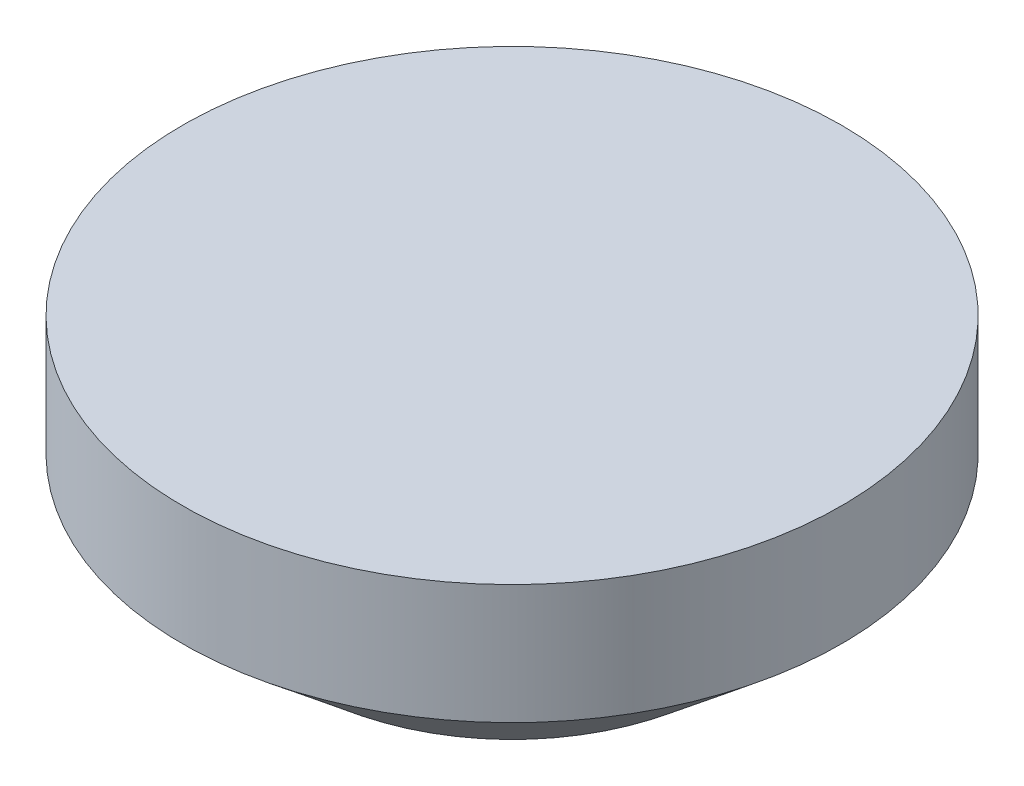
ISO-10303-21;
HEADER;
FILE_DESCRIPTION(('STEP AP214'),'2;1');
FILE_NAME('part.step','',(''),(''),'','','');
FILE_SCHEMA(('AUTOMOTIVE_DESIGN { 1 0 10303 214 1 1 1 1 }'));
ENDSEC;
DATA;
#1=APPLICATION_CONTEXT('core data for automotive mechanical design processes');
#2=APPLICATION_PROTOCOL_DEFINITION('international standard','automotive_design',2000,#1);
#3=PRODUCT_CONTEXT('',#1,'mechanical');
#4=PRODUCT('Part','Part','',(#3));
#5=PRODUCT_RELATED_PRODUCT_CATEGORY('part','',(#4));
#6=PRODUCT_DEFINITION_FORMATION('','',#4);
#7=PRODUCT_DEFINITION_CONTEXT('part definition',#1,'design');
#8=PRODUCT_DEFINITION('design','',#6,#7);
#9=PRODUCT_DEFINITION_SHAPE('','',#8);
#10=(LENGTH_UNIT() NAMED_UNIT(*) SI_UNIT(.MILLI.,.METRE.));
#11=(NAMED_UNIT(*) PLANE_ANGLE_UNIT() SI_UNIT($,.RADIAN.));
#12=(NAMED_UNIT(*) SI_UNIT($,.STERADIAN.) SOLID_ANGLE_UNIT());
#13=UNCERTAINTY_MEASURE_WITH_UNIT(LENGTH_MEASURE(1.E-05),#10,'distance_accuracy_value','');
#14=(GEOMETRIC_REPRESENTATION_CONTEXT(3) GLOBAL_UNCERTAINTY_ASSIGNED_CONTEXT((#13)) GLOBAL_UNIT_ASSIGNED_CONTEXT((#10,
#11,#12)) REPRESENTATION_CONTEXT('',''));
#15=CARTESIAN_POINT('',(0.,0.,0.));
#16=DIRECTION('',(0.,0.,1.));
#17=DIRECTION('',(1.,0.,0.));
#18=AXIS2_PLACEMENT_3D('',#15,#16,#17);
#19=CARTESIAN_POINT('',(0.,375.,0.));
#20=DIRECTION('',(0.,1.,0.));
#21=DIRECTION('',(0.,0.,1.));
#22=AXIS2_PLACEMENT_3D('',#19,#20,#21);
#23=PLANE('',#22);
#24=CARTESIAN_POINT('',(0.,375.,0.));
#25=DIRECTION('',(0.,-1.,0.));
#26=DIRECTION('',(0.,0.,-1.));
#27=AXIS2_PLACEMENT_3D('',#24,#25,#26);
#28=CIRCLE('',#27,565.);
#29=CARTESIAN_POINT('',(0.,375.,-565.));
#30=VERTEX_POINT('',#29);
#31=EDGE_CURVE('E10',#30,#30,#28,.T.);
#32=ORIENTED_EDGE('',*,*,#31,.F.);
#33=EDGE_LOOP('',(#32));
#34=FACE_BOUND('',#33,.T.);
#35=ADVANCED_FACE('F37',(#34),#23,.T.);
#36=CARTESIAN_POINT('',(0.,0.,0.));
#37=DIRECTION('',(0.,-1.,0.));
#38=DIRECTION('',(0.,0.,-1.));
#39=AXIS2_PLACEMENT_3D('',#36,#37,#38);
#40=CYLINDRICAL_SURFACE('',#39,565.);
#41=ORIENTED_EDGE('',*,*,#31,.T.);
#42=EDGE_LOOP('',(#41));
#43=FACE_BOUND('',#42,.T.);
#44=CARTESIAN_POINT('',(0.,170.,0.));
#45=DIRECTION('',(0.,-1.,0.));
#46=DIRECTION('',(0.,0.,-1.));
#47=AXIS2_PLACEMENT_3D('',#44,#45,#46);
#48=CIRCLE('',#47,565.);
#49=CARTESIAN_POINT('',(0.,170.,-565.));
#50=VERTEX_POINT('',#49);
#51=EDGE_CURVE('E43',#50,#50,#48,.T.);
#52=ORIENTED_EDGE('',*,*,#51,.F.);
#53=EDGE_LOOP('',(#52));
#54=FACE_BOUND('',#53,.T.);
#55=ADVANCED_FACE('F58',(#43,#54),#40,.T.);
#56=CARTESIAN_POINT('',(0.,0.,0.));
#57=DIRECTION('',(0.,1.,0.));
#58=DIRECTION('',(0.,0.,1.));
#59=AXIS2_PLACEMENT_3D('',#56,#57,#58);
#60=CONICAL_SURFACE('',#59,360.,0.878461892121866);
#61=ORIENTED_EDGE('',*,*,#51,.T.);
#62=EDGE_LOOP('',(#61));
#63=FACE_BOUND('',#62,.T.);
#64=CARTESIAN_POINT('',(0.,0.,0.));
#65=DIRECTION('',(0.,-1.,0.));
#66=DIRECTION('',(0.,0.,-1.));
#67=AXIS2_PLACEMENT_3D('',#64,#65,#66);
#68=CIRCLE('',#67,360.);
#69=CARTESIAN_POINT('',(0.,0.,-360.));
#70=VERTEX_POINT('',#69);
#71=EDGE_CURVE('E47',#70,#70,#68,.T.);
#72=ORIENTED_EDGE('',*,*,#71,.F.);
#73=EDGE_LOOP('',(#72));
#74=FACE_BOUND('',#73,.T.);
#75=ADVANCED_FACE('F56',(#63,#74),#60,.T.);
#76=CARTESIAN_POINT('',(360.,0.,0.));
#77=DIRECTION('',(0.,-1.,0.));
#78=DIRECTION('',(0.,0.,-1.));
#79=AXIS2_PLACEMENT_3D('',#76,#77,#78);
#80=PLANE('',#79);
#81=ORIENTED_EDGE('',*,*,#71,.T.);
#82=EDGE_LOOP('',(#81));
#83=FACE_BOUND('',#82,.T.);
#84=ADVANCED_FACE('F54',(#83),#80,.T.);
#85=CLOSED_SHELL('',(#35,#55,#75,#84));
#86=MANIFOLD_SOLID_BREP('B2',#85);
#87=ADVANCED_BREP_SHAPE_REPRESENTATION('',(#18,#86),#14);
#88=SHAPE_DEFINITION_REPRESENTATION(#9,#87);
ENDSEC;
END-ISO-10303-21;
